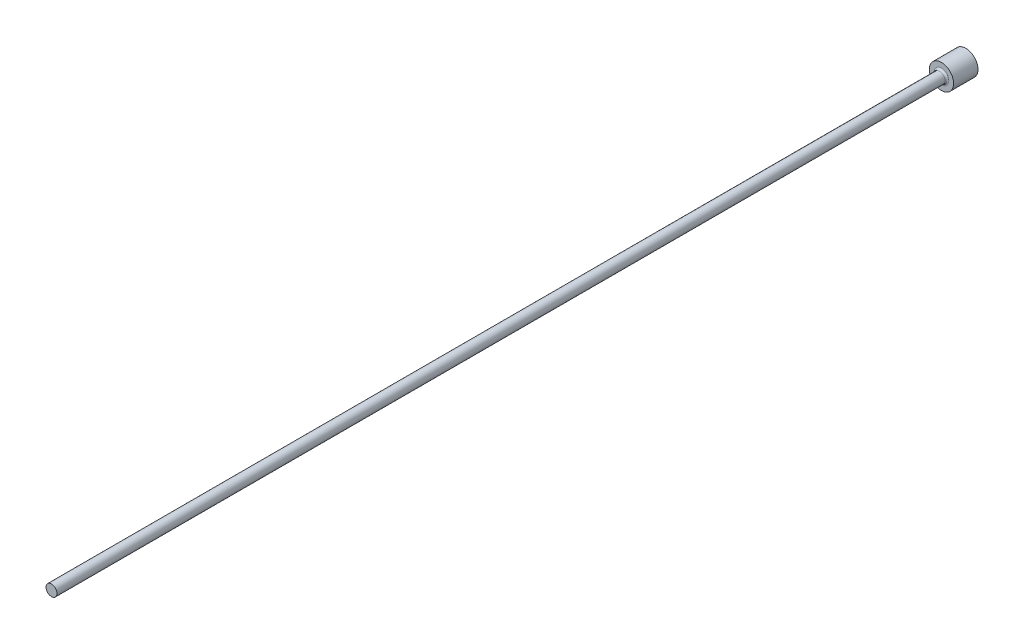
ISO-10303-21;
HEADER;
FILE_DESCRIPTION(('STEP AP214'),'2;1');
FILE_NAME('part.step','',(''),(''),'','','');
FILE_SCHEMA(('AUTOMOTIVE_DESIGN { 1 0 10303 214 1 1 1 1 }'));
ENDSEC;
DATA;
#1=APPLICATION_CONTEXT('core data for automotive mechanical design processes');
#2=APPLICATION_PROTOCOL_DEFINITION('international standard','automotive_design',2000,#1);
#3=PRODUCT_CONTEXT('',#1,'mechanical');
#4=PRODUCT('Part','Part','',(#3));
#5=PRODUCT_RELATED_PRODUCT_CATEGORY('part','',(#4));
#6=PRODUCT_DEFINITION_FORMATION('','',#4);
#7=PRODUCT_DEFINITION_CONTEXT('part definition',#1,'design');
#8=PRODUCT_DEFINITION('design','',#6,#7);
#9=PRODUCT_DEFINITION_SHAPE('','',#8);
#10=(LENGTH_UNIT() NAMED_UNIT(*) SI_UNIT(.MILLI.,.METRE.));
#11=(NAMED_UNIT(*) PLANE_ANGLE_UNIT() SI_UNIT($,.RADIAN.));
#12=(NAMED_UNIT(*) SI_UNIT($,.STERADIAN.) SOLID_ANGLE_UNIT());
#13=UNCERTAINTY_MEASURE_WITH_UNIT(LENGTH_MEASURE(1.E-05),#10,'distance_accuracy_value','');
#14=(GEOMETRIC_REPRESENTATION_CONTEXT(3) GLOBAL_UNCERTAINTY_ASSIGNED_CONTEXT((#13)) GLOBAL_UNIT_ASSIGNED_CONTEXT((#10,
#11,#12)) REPRESENTATION_CONTEXT('',''));
#15=CARTESIAN_POINT('',(0.,0.,0.));
#16=DIRECTION('',(0.,0.,1.));
#17=DIRECTION('',(1.,0.,0.));
#18=AXIS2_PLACEMENT_3D('',#15,#16,#17);
#19=CARTESIAN_POINT('',(2.,0.,4.));
#20=DIRECTION('',(0.,0.,-1.));
#21=DIRECTION('',(-1.,0.,0.));
#22=AXIS2_PLACEMENT_3D('',#19,#20,#21);
#23=PLANE('',#22);
#24=CARTESIAN_POINT('',(0.,0.,4.));
#25=DIRECTION('',(0.,0.,-1.));
#26=DIRECTION('',(-1.,0.,0.));
#27=AXIS2_PLACEMENT_3D('',#24,#25,#26);
#28=CIRCLE('',#27,1.20000000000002);
#29=CARTESIAN_POINT('',(-1.20000000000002,0.,4.));
#30=VERTEX_POINT('',#29);
#31=EDGE_CURVE('E40',#30,#30,#28,.T.);
#32=ORIENTED_EDGE('',*,*,#31,.T.);
#33=EDGE_LOOP('',(#32));
#34=FACE_BOUND('',#33,.T.);
#35=CARTESIAN_POINT('',(0.,0.,4.));
#36=DIRECTION('',(0.,0.,-1.));
#37=DIRECTION('',(-1.,0.,0.));
#38=AXIS2_PLACEMENT_3D('',#35,#36,#37);
#39=CIRCLE('',#38,2.);
#40=CARTESIAN_POINT('',(-2.,0.,4.));
#41=VERTEX_POINT('',#40);
#42=EDGE_CURVE('E44',#41,#41,#39,.T.);
#43=ORIENTED_EDGE('',*,*,#42,.F.);
#44=EDGE_LOOP('',(#43));
#45=FACE_BOUND('',#44,.T.);
#46=ADVANCED_FACE('F33',(#34,#45),#23,.F.);
#47=CARTESIAN_POINT('',(0.,0.,-9.03322817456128));
#48=DIRECTION('',(0.,0.,-1.));
#49=DIRECTION('',(-1.,0.,0.));
#50=AXIS2_PLACEMENT_3D('',#47,#48,#49);
#51=CYLINDRICAL_SURFACE('',#50,2.);
#52=CARTESIAN_POINT('',(0.,0.,0.));
#53=DIRECTION('',(0.,0.,-1.));
#54=DIRECTION('',(-1.,0.,0.));
#55=AXIS2_PLACEMENT_3D('',#52,#53,#54);
#56=CIRCLE('',#55,2.);
#57=CARTESIAN_POINT('',(-2.,0.,0.));
#58=VERTEX_POINT('',#57);
#59=EDGE_CURVE('E48',#58,#58,#56,.T.);
#60=ORIENTED_EDGE('',*,*,#59,.F.);
#61=EDGE_LOOP('',(#60));
#62=FACE_BOUND('',#61,.T.);
#63=ORIENTED_EDGE('',*,*,#42,.T.);
#64=EDGE_LOOP('',(#63));
#65=FACE_BOUND('',#64,.T.);
#66=ADVANCED_FACE('F68',(#62,#65),#51,.T.);
#67=CARTESIAN_POINT('',(0.,0.,0.));
#68=DIRECTION('',(0.,0.,1.));
#69=DIRECTION('',(1.,0.,0.));
#70=AXIS2_PLACEMENT_3D('',#67,#68,#69);
#71=PLANE('',#70);
#72=ORIENTED_EDGE('',*,*,#59,.T.);
#73=EDGE_LOOP('',(#72));
#74=FACE_BOUND('',#73,.T.);
#75=ADVANCED_FACE('F61',(#74),#71,.F.);
#76=CARTESIAN_POINT('',(0.,0.,150.));
#77=DIRECTION('',(0.,0.,-1.));
#78=DIRECTION('',(-1.,0.,0.));
#79=AXIS2_PLACEMENT_3D('',#76,#77,#78);
#80=PLANE('',#79);
#81=CARTESIAN_POINT('',(0.,0.,150.));
#82=DIRECTION('',(0.,0.,-1.));
#83=DIRECTION('',(-1.,0.,0.));
#84=AXIS2_PLACEMENT_3D('',#81,#82,#83);
#85=CIRCLE('',#84,0.90000000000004);
#86=CARTESIAN_POINT('',(-0.900000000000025,0.,150.));
#87=VERTEX_POINT('',#86);
#88=EDGE_CURVE('E53',#87,#87,#85,.T.);
#89=ORIENTED_EDGE('',*,*,#88,.F.);
#90=EDGE_LOOP('',(#89));
#91=FACE_BOUND('',#90,.T.);
#92=ADVANCED_FACE('F59',(#91),#80,.F.);
#93=CARTESIAN_POINT('',(0.,0.,-9.03322817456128));
#94=DIRECTION('',(0.,0.,-1.));
#95=DIRECTION('',(-1.,0.,0.));
#96=AXIS2_PLACEMENT_3D('',#93,#94,#95);
#97=CYLINDRICAL_SURFACE('',#96,0.90000000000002);
#98=CARTESIAN_POINT('',(0.,0.,4.3));
#99=DIRECTION('',(0.,0.,-1.));
#100=DIRECTION('',(-1.,0.,0.));
#101=AXIS2_PLACEMENT_3D('',#98,#99,#100);
#102=CIRCLE('',#101,0.90000000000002);
#103=CARTESIAN_POINT('',(-0.900000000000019,0.,4.3));
#104=VERTEX_POINT('',#103);
#105=EDGE_CURVE('E10',#104,#104,#102,.F.);
#106=ORIENTED_EDGE('',*,*,#105,.T.);
#107=EDGE_LOOP('',(#106));
#108=FACE_BOUND('',#107,.T.);
#109=ORIENTED_EDGE('',*,*,#88,.T.);
#110=EDGE_LOOP('',(#109));
#111=FACE_BOUND('',#110,.T.);
#112=ADVANCED_FACE('F57',(#108,#111),#97,.T.);
#113=CARTESIAN_POINT('',(0.,0.,4.3));
#114=DIRECTION('',(0.,0.,-1.));
#115=DIRECTION('',(-1.,0.,0.));
#116=AXIS2_PLACEMENT_3D('',#113,#114,#115);
#117=TOROIDAL_SURFACE('',#116,1.20000000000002,0.3);
#118=ORIENTED_EDGE('',*,*,#105,.F.);
#119=EDGE_LOOP('',(#118));
#120=FACE_BOUND('',#119,.T.);
#121=ORIENTED_EDGE('',*,*,#31,.F.);
#122=EDGE_LOOP('',(#121));
#123=FACE_BOUND('',#122,.T.);
#124=ADVANCED_FACE('F35',(#120,#123),#117,.F.);
#125=CLOSED_SHELL('',(#46,#66,#75,#92,#112,#124));
#126=MANIFOLD_SOLID_BREP('B2',#125);
#127=ADVANCED_BREP_SHAPE_REPRESENTATION('',(#18,#126),#14);
#128=SHAPE_DEFINITION_REPRESENTATION(#9,#127);
ENDSEC;
END-ISO-10303-21;
